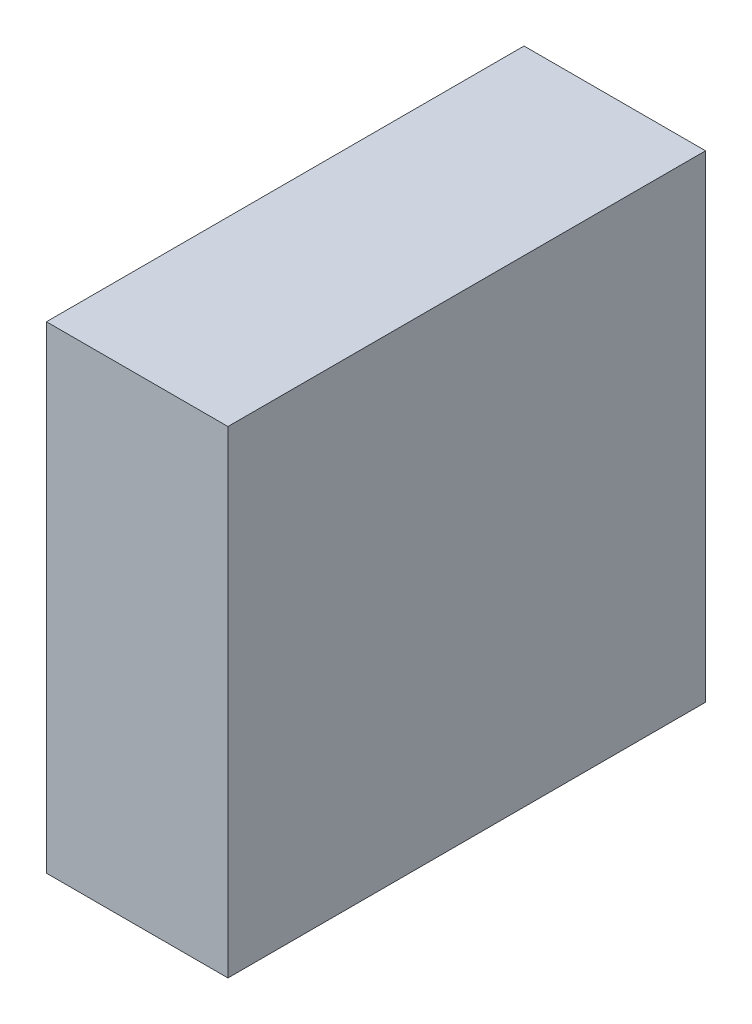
ISO-10303-21;
HEADER;
FILE_DESCRIPTION(('STEP AP214'),'2;1');
FILE_NAME('part.step','',(''),(''),'','','');
FILE_SCHEMA(('AUTOMOTIVE_DESIGN { 1 0 10303 214 1 1 1 1 }'));
ENDSEC;
DATA;
#1=APPLICATION_CONTEXT('core data for automotive mechanical design processes');
#2=APPLICATION_PROTOCOL_DEFINITION('international standard','automotive_design',2000,#1);
#3=PRODUCT_CONTEXT('',#1,'mechanical');
#4=PRODUCT('Part','Part','',(#3));
#5=PRODUCT_RELATED_PRODUCT_CATEGORY('part','',(#4));
#6=PRODUCT_DEFINITION_FORMATION('','',#4);
#7=PRODUCT_DEFINITION_CONTEXT('part definition',#1,'design');
#8=PRODUCT_DEFINITION('design','',#6,#7);
#9=PRODUCT_DEFINITION_SHAPE('','',#8);
#10=(LENGTH_UNIT() NAMED_UNIT(*) SI_UNIT(.MILLI.,.METRE.));
#11=(NAMED_UNIT(*) PLANE_ANGLE_UNIT() SI_UNIT($,.RADIAN.));
#12=(NAMED_UNIT(*) SI_UNIT($,.STERADIAN.) SOLID_ANGLE_UNIT());
#13=UNCERTAINTY_MEASURE_WITH_UNIT(LENGTH_MEASURE(1.E-05),#10,'distance_accuracy_value','');
#14=(GEOMETRIC_REPRESENTATION_CONTEXT(3) GLOBAL_UNCERTAINTY_ASSIGNED_CONTEXT((#13)) GLOBAL_UNIT_ASSIGNED_CONTEXT((#10,
#11,#12)) REPRESENTATION_CONTEXT('',''));
#15=CARTESIAN_POINT('',(0.,0.,0.));
#16=DIRECTION('',(0.,0.,1.));
#17=DIRECTION('',(1.,0.,0.));
#18=AXIS2_PLACEMENT_3D('',#15,#16,#17);
#19=CARTESIAN_POINT('',(1.26999998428E-06,0.,1.79999894));
#20=DIRECTION('',(0.,0.,-1.));
#21=DIRECTION('',(0.,-1.,0.));
#22=AXIS2_PLACEMENT_3D('',#19,#20,#21);
#23=PLANE('',#22);
#24=DIRECTION('',(0.,-1.,0.));
#25=VECTOR('',#24,1.);
#26=CARTESIAN_POINT('',(0.34200084,0.90000074,1.79999894));
#27=LINE('',#26,#25);
#28=CARTESIAN_POINT('',(0.34200084,0.90000074,1.79999894));
#29=VERTEX_POINT('',#28);
#30=CARTESIAN_POINT('',(0.34200084,-0.90000074,1.79999894));
#31=VERTEX_POINT('',#30);
#32=EDGE_CURVE('E25',#29,#31,#27,.T.);
#33=ORIENTED_EDGE('',*,*,#32,.F.);
#34=DIRECTION('',(1.,0.,0.));
#35=VECTOR('',#34,1.);
#36=CARTESIAN_POINT('',(-0.3419983,0.90000074,1.79999894));
#37=LINE('',#36,#35);
#38=CARTESIAN_POINT('',(-0.3419983,0.90000074,1.79999894));
#39=VERTEX_POINT('',#38);
#40=EDGE_CURVE('E99',#39,#29,#37,.T.);
#41=ORIENTED_EDGE('',*,*,#40,.F.);
#42=DIRECTION('',(0.,1.,0.));
#43=VECTOR('',#42,1.);
#44=CARTESIAN_POINT('',(-0.3419983,-0.90000074,1.79999894));
#45=LINE('',#44,#43);
#46=CARTESIAN_POINT('',(-0.3419983,-0.90000074,1.79999894));
#47=VERTEX_POINT('',#46);
#48=EDGE_CURVE('E77',#47,#39,#45,.T.);
#49=ORIENTED_EDGE('',*,*,#48,.F.);
#50=DIRECTION('',(-1.,0.,0.));
#51=VECTOR('',#50,1.);
#52=CARTESIAN_POINT('',(0.34200084,-0.90000074,1.79999894));
#53=LINE('',#52,#51);
#54=EDGE_CURVE('E75',#31,#47,#53,.T.);
#55=ORIENTED_EDGE('',*,*,#54,.F.);
#56=EDGE_LOOP('',(#33,#41,#49,#55));
#57=FACE_BOUND('',#56,.T.);
#58=ADVANCED_FACE('F17',(#57),#23,.F.);
#59=CARTESIAN_POINT('',(1.26999998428E-06,0.,0.));
#60=DIRECTION('',(0.,0.,-1.));
#61=DIRECTION('',(0.,-1.,0.));
#62=AXIS2_PLACEMENT_3D('',#59,#60,#61);
#63=PLANE('',#62);
#64=DIRECTION('',(-1.,0.,0.));
#65=VECTOR('',#64,1.);
#66=CARTESIAN_POINT('',(0.34200084,-0.90000074,0.));
#67=LINE('',#66,#65);
#68=CARTESIAN_POINT('',(0.34200084,-0.90000074,0.));
#69=VERTEX_POINT('',#68);
#70=CARTESIAN_POINT('',(-0.3419983,-0.90000074,0.));
#71=VERTEX_POINT('',#70);
#72=EDGE_CURVE('E87',#69,#71,#67,.T.);
#73=ORIENTED_EDGE('',*,*,#72,.T.);
#74=DIRECTION('',(0.,1.,0.));
#75=VECTOR('',#74,1.);
#76=CARTESIAN_POINT('',(-0.3419983,-0.90000074,0.));
#77=LINE('',#76,#75);
#78=CARTESIAN_POINT('',(-0.3419983,0.90000074,0.));
#79=VERTEX_POINT('',#78);
#80=EDGE_CURVE('E96',#71,#79,#77,.T.);
#81=ORIENTED_EDGE('',*,*,#80,.T.);
#82=DIRECTION('',(1.,0.,0.));
#83=VECTOR('',#82,1.);
#84=CARTESIAN_POINT('',(-0.3419983,0.90000074,0.));
#85=LINE('',#84,#83);
#86=CARTESIAN_POINT('',(0.34200084,0.90000074,0.));
#87=VERTEX_POINT('',#86);
#88=EDGE_CURVE('E73',#79,#87,#85,.T.);
#89=ORIENTED_EDGE('',*,*,#88,.T.);
#90=DIRECTION('',(0.,-1.,0.));
#91=VECTOR('',#90,1.);
#92=CARTESIAN_POINT('',(0.34200084,0.90000074,0.));
#93=LINE('',#92,#91);
#94=EDGE_CURVE('E11',#87,#69,#93,.T.);
#95=ORIENTED_EDGE('',*,*,#94,.T.);
#96=EDGE_LOOP('',(#73,#81,#89,#95));
#97=FACE_BOUND('',#96,.T.);
#98=ADVANCED_FACE('F115',(#97),#63,.T.);
#99=CARTESIAN_POINT('',(0.34200084,0.90000074,0.));
#100=DIRECTION('',(1.,0.,0.));
#101=DIRECTION('',(0.,1.,0.));
#102=AXIS2_PLACEMENT_3D('',#99,#100,#101);
#103=PLANE('',#102);
#104=DIRECTION('',(0.,0.,1.));
#105=VECTOR('',#104,1.);
#106=CARTESIAN_POINT('',(0.34200084,0.90000074,0.));
#107=LINE('',#106,#105);
#108=EDGE_CURVE('E70',#87,#29,#107,.T.);
#109=ORIENTED_EDGE('',*,*,#108,.T.);
#110=ORIENTED_EDGE('',*,*,#32,.T.);
#111=DIRECTION('',(0.,0.,1.));
#112=VECTOR('',#111,1.);
#113=CARTESIAN_POINT('',(0.34200084,-0.90000074,0.));
#114=LINE('',#113,#112);
#115=EDGE_CURVE('E68',#69,#31,#114,.T.);
#116=ORIENTED_EDGE('',*,*,#115,.F.);
#117=ORIENTED_EDGE('',*,*,#94,.F.);
#118=EDGE_LOOP('',(#109,#110,#116,#117));
#119=FACE_BOUND('',#118,.T.);
#120=ADVANCED_FACE('F66',(#119),#103,.T.);
#121=CARTESIAN_POINT('',(-0.3419983,0.90000074,0.));
#122=DIRECTION('',(0.,1.,0.));
#123=DIRECTION('',(1.,0.,0.));
#124=AXIS2_PLACEMENT_3D('',#121,#122,#123);
#125=PLANE('',#124);
#126=DIRECTION('',(0.,0.,1.));
#127=VECTOR('',#126,1.);
#128=CARTESIAN_POINT('',(-0.3419983,0.90000074,0.));
#129=LINE('',#128,#127);
#130=EDGE_CURVE('E95',#79,#39,#129,.T.);
#131=ORIENTED_EDGE('',*,*,#130,.T.);
#132=ORIENTED_EDGE('',*,*,#40,.T.);
#133=ORIENTED_EDGE('',*,*,#108,.F.);
#134=ORIENTED_EDGE('',*,*,#88,.F.);
#135=EDGE_LOOP('',(#131,#132,#133,#134));
#136=FACE_BOUND('',#135,.T.);
#137=ADVANCED_FACE('F119',(#136),#125,.T.);
#138=CARTESIAN_POINT('',(-0.3419983,-0.90000074,0.));
#139=DIRECTION('',(-1.,0.,0.));
#140=DIRECTION('',(0.,0.,1.));
#141=AXIS2_PLACEMENT_3D('',#138,#139,#140);
#142=PLANE('',#141);
#143=DIRECTION('',(0.,0.,1.));
#144=VECTOR('',#143,1.);
#145=CARTESIAN_POINT('',(-0.3419983,-0.90000074,0.));
#146=LINE('',#145,#144);
#147=EDGE_CURVE('E82',#71,#47,#146,.T.);
#148=ORIENTED_EDGE('',*,*,#147,.T.);
#149=ORIENTED_EDGE('',*,*,#48,.T.);
#150=ORIENTED_EDGE('',*,*,#130,.F.);
#151=ORIENTED_EDGE('',*,*,#80,.F.);
#152=EDGE_LOOP('',(#148,#149,#150,#151));
#153=FACE_BOUND('',#152,.T.);
#154=ADVANCED_FACE('F122',(#153),#142,.T.);
#155=CARTESIAN_POINT('',(0.34200084,-0.90000074,0.));
#156=DIRECTION('',(0.,-1.,0.));
#157=DIRECTION('',(0.,0.,-1.));
#158=AXIS2_PLACEMENT_3D('',#155,#156,#157);
#159=PLANE('',#158);
#160=ORIENTED_EDGE('',*,*,#115,.T.);
#161=ORIENTED_EDGE('',*,*,#54,.T.);
#162=ORIENTED_EDGE('',*,*,#147,.F.);
#163=ORIENTED_EDGE('',*,*,#72,.F.);
#164=EDGE_LOOP('',(#160,#161,#162,#163));
#165=FACE_BOUND('',#164,.T.);
#166=ADVANCED_FACE('F85',(#165),#159,.T.);
#167=CLOSED_SHELL('',(#58,#98,#120,#137,#154,#166));
#168=MANIFOLD_SOLID_BREP('B1',#167);
#169=ADVANCED_BREP_SHAPE_REPRESENTATION('',(#18,#168),#14);
#170=SHAPE_DEFINITION_REPRESENTATION(#9,#169);
ENDSEC;
END-ISO-10303-21;
